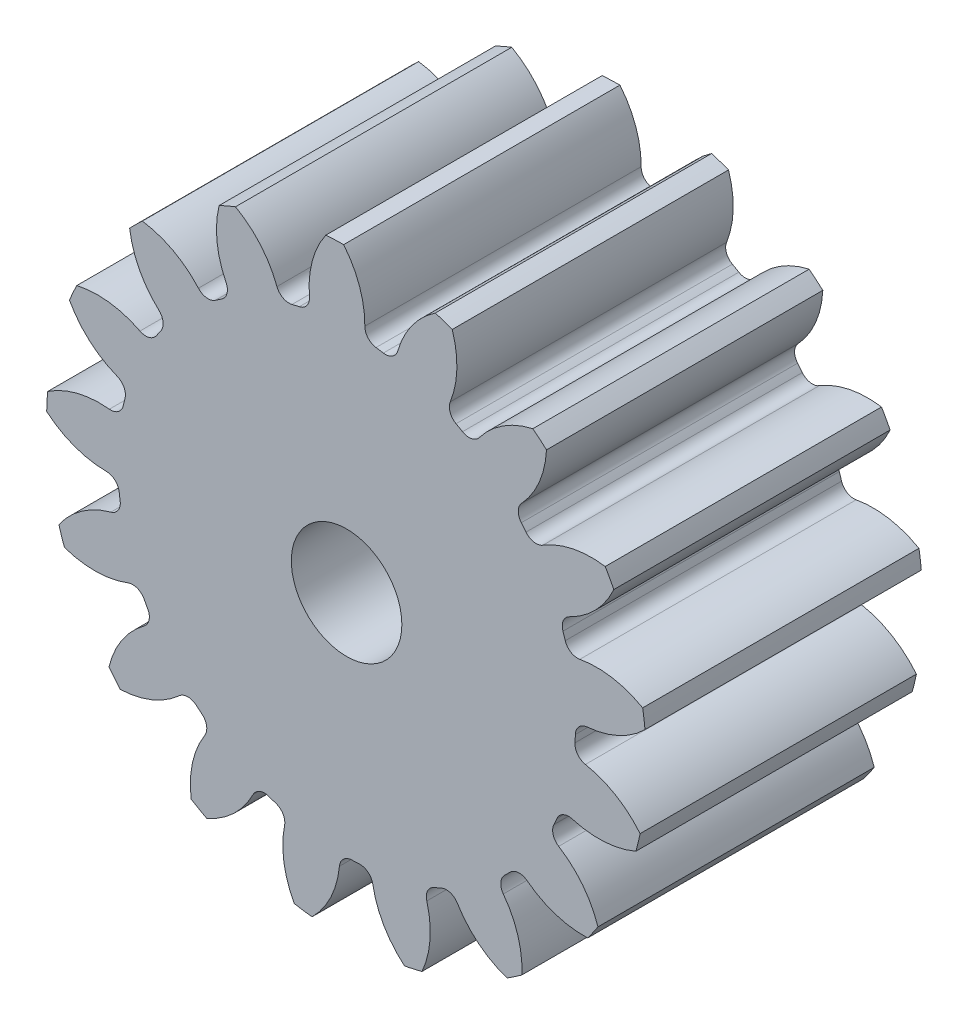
from build123d import *

# Parameters (mm, degrees)
SKETCH3_R         = 96.52
GEARBODY_DEPTH    = 88.9
TOOTHCUT_DEPTH    = 163.896994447
CIRPATTERN1_COUNT = 17
BOREDIA_R         = 17.78
BORE_DEPTH        = 12700


with BuildPart() as part:
    # Sketch3 → gearBody (new body)
    with BuildSketch(Plane.XY):
        Circle(SKETCH3_R)
    extrude(amount=GEARBODY_DEPTH)

    # Sketch2 → toothCut (cut, through all)
    with BuildSketch(Plane.XY):
        with BuildLine():
            ThreePointArc((73.484073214, -5.087885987), (73.557140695, -3.891356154), (73.61072656, -2.693795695))
            ThreePointArc((73.61072656, -2.693795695), (74.754198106, 0.012566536), (77.406499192, 1.276379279))
            ThreePointArc((77.406499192, 1.276379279), (87.793874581, 4.06707836), (96.52, 10.355186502))
            ThreePointArc((96.52, 10.355186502), (96.938336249, -5.128279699), (94.88867917, -20.481182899))
            ThreePointArc((94.88867917, -20.481182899), (86.874716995, -13.307482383), (76.839766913, -9.436391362))
            ThreePointArc((76.839766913, -9.436391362), (74.335614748, -7.899789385), (73.484073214, -5.087885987))
        make_face()
    toothcut = extrude(amount=TOOTHCUT_DEPTH, mode=Mode.SUBTRACT)

    # CirPattern1: toothCut ×17 about axis
    cirpattern1_axis = Axis((0, 0, 0), (0, 0, 1))
    for i in range(1, CIRPATTERN1_COUNT):
        add(toothcut.rotate(cirpattern1_axis, i * 360 / CIRPATTERN1_COUNT), mode=Mode.SUBTRACT)

    # boreDia → bore (cut, symmetric)
    with BuildSketch(Plane.XY):
        Circle(BOREDIA_R)
    extrude(amount=BORE_DEPTH, both=True, mode=Mode.SUBTRACT)


solid = part.part
